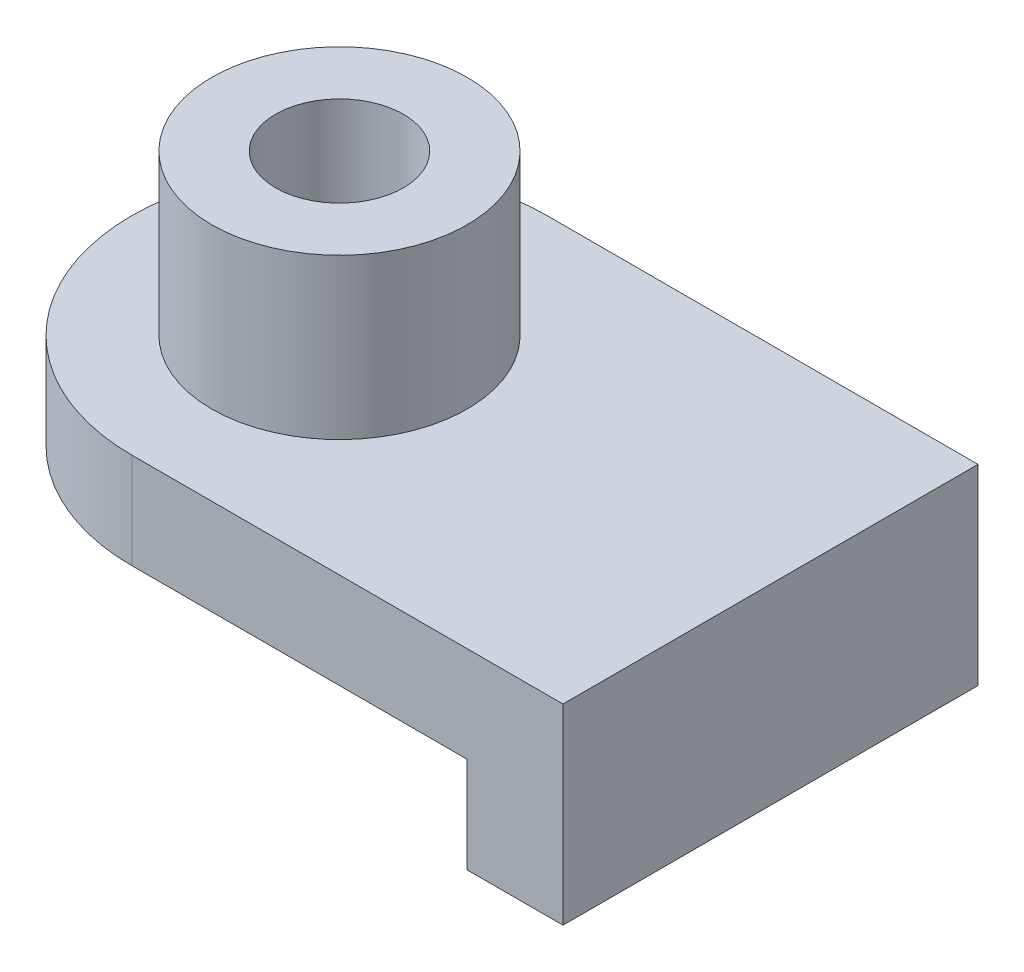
ISO-10303-21;
HEADER;
FILE_DESCRIPTION(('STEP AP214'),'2;1');
FILE_NAME('part.step','',(''),(''),'','','');
FILE_SCHEMA(('AUTOMOTIVE_DESIGN { 1 0 10303 214 1 1 1 1 }'));
ENDSEC;
DATA;
#1=APPLICATION_CONTEXT('core data for automotive mechanical design processes');
#2=APPLICATION_PROTOCOL_DEFINITION('international standard','automotive_design',2000,#1);
#3=PRODUCT_CONTEXT('',#1,'mechanical');
#4=PRODUCT('Part','Part','',(#3));
#5=PRODUCT_RELATED_PRODUCT_CATEGORY('part','',(#4));
#6=PRODUCT_DEFINITION_FORMATION('','',#4);
#7=PRODUCT_DEFINITION_CONTEXT('part definition',#1,'design');
#8=PRODUCT_DEFINITION('design','',#6,#7);
#9=PRODUCT_DEFINITION_SHAPE('','',#8);
#10=(LENGTH_UNIT() NAMED_UNIT(*) SI_UNIT(.MILLI.,.METRE.));
#11=(NAMED_UNIT(*) PLANE_ANGLE_UNIT() SI_UNIT($,.RADIAN.));
#12=(NAMED_UNIT(*) SI_UNIT($,.STERADIAN.) SOLID_ANGLE_UNIT());
#13=UNCERTAINTY_MEASURE_WITH_UNIT(LENGTH_MEASURE(1.E-05),#10,'distance_accuracy_value','');
#14=(GEOMETRIC_REPRESENTATION_CONTEXT(3) GLOBAL_UNCERTAINTY_ASSIGNED_CONTEXT((#13)) GLOBAL_UNIT_ASSIGNED_CONTEXT((#10,
#11,#12)) REPRESENTATION_CONTEXT('',''));
#15=CARTESIAN_POINT('',(0.,0.,0.));
#16=DIRECTION('',(0.,0.,1.));
#17=DIRECTION('',(1.,0.,0.));
#18=AXIS2_PLACEMENT_3D('',#15,#16,#17);
#19=CARTESIAN_POINT('',(-67.5,15.,0.));
#20=DIRECTION('',(0.,0.,-1.));
#21=DIRECTION('',(-1.,0.,0.));
#22=AXIS2_PLACEMENT_3D('',#19,#20,#21);
#23=PLANE('',#22);
#24=DIRECTION('',(1.,0.,0.));
#25=VECTOR('',#24,1.);
#26=CARTESIAN_POINT('',(-67.5,0.,0.));
#27=LINE('',#26,#25);
#28=CARTESIAN_POINT('',(-67.5,0.,0.));
#29=VERTEX_POINT('',#28);
#30=CARTESIAN_POINT('',(-15.,0.,0.));
#31=VERTEX_POINT('',#30);
#32=EDGE_CURVE('E121',#29,#31,#27,.T.);
#33=ORIENTED_EDGE('',*,*,#32,.T.);
#34=DIRECTION('',(0.,-1.,0.));
#35=VECTOR('',#34,1.);
#36=CARTESIAN_POINT('',(-15.,-15.,0.));
#37=LINE('',#36,#35);
#38=CARTESIAN_POINT('',(-15.,-15.,0.));
#39=VERTEX_POINT('',#38);
#40=EDGE_CURVE('E54',#31,#39,#37,.T.);
#41=ORIENTED_EDGE('',*,*,#40,.T.);
#42=DIRECTION('',(1.,0.,0.));
#43=VECTOR('',#42,1.);
#44=CARTESIAN_POINT('',(0.,-15.,0.));
#45=LINE('',#44,#43);
#46=CARTESIAN_POINT('',(0.,-15.,0.));
#47=VERTEX_POINT('',#46);
#48=EDGE_CURVE('E117',#39,#47,#45,.T.);
#49=ORIENTED_EDGE('',*,*,#48,.T.);
#50=DIRECTION('',(0.,-1.,0.));
#51=VECTOR('',#50,1.);
#52=CARTESIAN_POINT('',(0.,15.,0.));
#53=LINE('',#52,#51);
#54=CARTESIAN_POINT('',(0.,15.,0.));
#55=VERTEX_POINT('',#54);
#56=EDGE_CURVE('E11',#55,#47,#53,.T.);
#57=ORIENTED_EDGE('',*,*,#56,.F.);
#58=DIRECTION('',(1.,0.,0.));
#59=VECTOR('',#58,1.);
#60=CARTESIAN_POINT('',(-67.5,15.,0.));
#61=LINE('',#60,#59);
#62=CARTESIAN_POINT('',(-67.5,15.,0.));
#63=VERTEX_POINT('',#62);
#64=EDGE_CURVE('E125',#63,#55,#61,.T.);
#65=ORIENTED_EDGE('',*,*,#64,.F.);
#66=DIRECTION('',(0.,-1.,0.));
#67=VECTOR('',#66,1.);
#68=CARTESIAN_POINT('',(-67.5,15.,0.));
#69=LINE('',#68,#67);
#70=EDGE_CURVE('E131',#63,#29,#69,.T.);
#71=ORIENTED_EDGE('',*,*,#70,.T.);
#72=EDGE_LOOP('',(#33,#41,#49,#57,#65,#71));
#73=FACE_BOUND('',#72,.T.);
#74=ADVANCED_FACE('F39',(#73),#23,.F.);
#75=CARTESIAN_POINT('',(0.,15.,0.));
#76=DIRECTION('',(-1.,0.,0.));
#77=DIRECTION('',(0.,0.,1.));
#78=AXIS2_PLACEMENT_3D('',#75,#76,#77);
#79=PLANE('',#78);
#80=ORIENTED_EDGE('',*,*,#56,.T.);
#81=DIRECTION('',(0.,0.,1.));
#82=VECTOR('',#81,1.);
#83=CARTESIAN_POINT('',(0.,-15.,-65.));
#84=LINE('',#83,#82);
#85=CARTESIAN_POINT('',(0.,-15.,-65.));
#86=VERTEX_POINT('',#85);
#87=EDGE_CURVE('E127',#86,#47,#84,.T.);
#88=ORIENTED_EDGE('',*,*,#87,.F.);
#89=DIRECTION('',(0.,-1.,0.));
#90=VECTOR('',#89,1.);
#91=CARTESIAN_POINT('',(0.,15.,-65.));
#92=LINE('',#91,#90);
#93=CARTESIAN_POINT('',(0.,15.,-65.));
#94=VERTEX_POINT('',#93);
#95=EDGE_CURVE('E47',#94,#86,#92,.T.);
#96=ORIENTED_EDGE('',*,*,#95,.F.);
#97=DIRECTION('',(0.,0.,-1.));
#98=VECTOR('',#97,1.);
#99=CARTESIAN_POINT('',(0.,15.,0.));
#100=LINE('',#99,#98);
#101=EDGE_CURVE('E85',#55,#94,#100,.T.);
#102=ORIENTED_EDGE('',*,*,#101,.F.);
#103=EDGE_LOOP('',(#80,#88,#96,#102));
#104=FACE_BOUND('',#103,.T.);
#105=ADVANCED_FACE('F141',(#104),#79,.F.);
#106=CARTESIAN_POINT('',(0.,15.,-65.));
#107=DIRECTION('',(0.,0.,1.));
#108=DIRECTION('',(1.,0.,0.));
#109=AXIS2_PLACEMENT_3D('',#106,#107,#108);
#110=PLANE('',#109);
#111=ORIENTED_EDGE('',*,*,#95,.T.);
#112=DIRECTION('',(1.,0.,0.));
#113=VECTOR('',#112,1.);
#114=CARTESIAN_POINT('',(0.,-15.,-65.));
#115=LINE('',#114,#113);
#116=CARTESIAN_POINT('',(-15.,-15.,-65.));
#117=VERTEX_POINT('',#116);
#118=EDGE_CURVE('E108',#117,#86,#115,.T.);
#119=ORIENTED_EDGE('',*,*,#118,.F.);
#120=DIRECTION('',(0.,-1.,0.));
#121=VECTOR('',#120,1.);
#122=CARTESIAN_POINT('',(-15.,-15.,-65.));
#123=LINE('',#122,#121);
#124=CARTESIAN_POINT('',(-15.,0.,-65.));
#125=VERTEX_POINT('',#124);
#126=EDGE_CURVE('E101',#125,#117,#123,.T.);
#127=ORIENTED_EDGE('',*,*,#126,.F.);
#128=DIRECTION('',(-1.,0.,0.));
#129=VECTOR('',#128,1.);
#130=CARTESIAN_POINT('',(0.,0.,-65.));
#131=LINE('',#130,#129);
#132=CARTESIAN_POINT('',(-67.5,0.,-65.));
#133=VERTEX_POINT('',#132);
#134=EDGE_CURVE('E114',#125,#133,#131,.T.);
#135=ORIENTED_EDGE('',*,*,#134,.T.);
#136=DIRECTION('',(0.,-1.,0.));
#137=VECTOR('',#136,1.);
#138=CARTESIAN_POINT('',(-67.5,15.,-65.));
#139=LINE('',#138,#137);
#140=CARTESIAN_POINT('',(-67.5,15.,-65.));
#141=VERTEX_POINT('',#140);
#142=EDGE_CURVE('E134',#141,#133,#139,.T.);
#143=ORIENTED_EDGE('',*,*,#142,.F.);
#144=DIRECTION('',(-1.,0.,0.));
#145=VECTOR('',#144,1.);
#146=CARTESIAN_POINT('',(0.,15.,-65.));
#147=LINE('',#146,#145);
#148=EDGE_CURVE('E139',#94,#141,#147,.T.);
#149=ORIENTED_EDGE('',*,*,#148,.F.);
#150=EDGE_LOOP('',(#111,#119,#127,#135,#143,#149));
#151=FACE_BOUND('',#150,.T.);
#152=ADVANCED_FACE('F112',(#151),#110,.F.);
#153=CARTESIAN_POINT('',(-67.5,15.,-32.5));
#154=DIRECTION('',(0.,-1.,0.));
#155=DIRECTION('',(0.,0.,-1.));
#156=AXIS2_PLACEMENT_3D('',#153,#154,#155);
#157=CYLINDRICAL_SURFACE('',#156,32.5);
#158=CARTESIAN_POINT('',(-67.5,0.,-32.5));
#159=DIRECTION('',(0.,1.,0.));
#160=DIRECTION('',(0.,0.,1.));
#161=AXIS2_PLACEMENT_3D('',#158,#159,#160);
#162=CIRCLE('',#161,32.5);
#163=EDGE_CURVE('E78',#133,#29,#162,.T.);
#164=ORIENTED_EDGE('',*,*,#163,.T.);
#165=ORIENTED_EDGE('',*,*,#70,.F.);
#166=CARTESIAN_POINT('',(-67.5,15.,-32.5));
#167=DIRECTION('',(0.,1.,0.));
#168=DIRECTION('',(0.,0.,1.));
#169=AXIS2_PLACEMENT_3D('',#166,#167,#168);
#170=CIRCLE('',#169,32.5);
#171=EDGE_CURVE('E63',#141,#63,#170,.T.);
#172=ORIENTED_EDGE('',*,*,#171,.F.);
#173=ORIENTED_EDGE('',*,*,#142,.T.);
#174=EDGE_LOOP('',(#164,#165,#172,#173));
#175=FACE_BOUND('',#174,.T.);
#176=ADVANCED_FACE('F167',(#175),#157,.T.);
#177=CARTESIAN_POINT('',(-67.5,15.,-32.5));
#178=DIRECTION('',(0.,1.,0.));
#179=DIRECTION('',(0.,0.,1.));
#180=AXIS2_PLACEMENT_3D('',#177,#178,#179);
#181=PLANE('',#180);
#182=CARTESIAN_POINT('',(-67.5,15.,-32.5));
#183=DIRECTION('',(0.,1.,0.));
#184=DIRECTION('',(0.,0.,1.));
#185=AXIS2_PLACEMENT_3D('',#182,#183,#184);
#186=CIRCLE('',#185,20.);
#187=CARTESIAN_POINT('',(-67.5,15.,-12.5));
#188=VERTEX_POINT('',#187);
#189=EDGE_CURVE('E212',#188,#188,#186,.T.);
#190=ORIENTED_EDGE('',*,*,#189,.F.);
#191=EDGE_LOOP('',(#190));
#192=FACE_BOUND('',#191,.T.);
#193=ORIENTED_EDGE('',*,*,#64,.T.);
#194=ORIENTED_EDGE('',*,*,#101,.T.);
#195=ORIENTED_EDGE('',*,*,#148,.T.);
#196=ORIENTED_EDGE('',*,*,#171,.T.);
#197=EDGE_LOOP('',(#193,#194,#195,#196));
#198=FACE_BOUND('',#197,.T.);
#199=ADVANCED_FACE('F166',(#192,#198),#181,.T.);
#200=CARTESIAN_POINT('',(-67.5,0.,-32.5));
#201=DIRECTION('',(0.,1.,0.));
#202=DIRECTION('',(0.,0.,1.));
#203=AXIS2_PLACEMENT_3D('',#200,#201,#202);
#204=PLANE('',#203);
#205=CARTESIAN_POINT('',(-67.5,0.,-32.5));
#206=DIRECTION('',(0.,1.,0.));
#207=DIRECTION('',(0.,0.,1.));
#208=AXIS2_PLACEMENT_3D('',#205,#206,#207);
#209=CIRCLE('',#208,9.99999999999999);
#210=CARTESIAN_POINT('',(-67.5,0.,-22.5));
#211=VERTEX_POINT('',#210);
#212=EDGE_CURVE('E210',#211,#211,#209,.T.);
#213=ORIENTED_EDGE('',*,*,#212,.T.);
#214=EDGE_LOOP('',(#213));
#215=FACE_BOUND('',#214,.T.);
#216=ORIENTED_EDGE('',*,*,#134,.F.);
#217=DIRECTION('',(0.,0.,1.));
#218=VECTOR('',#217,1.);
#219=CARTESIAN_POINT('',(-15.,0.,-65.));
#220=LINE('',#219,#218);
#221=EDGE_CURVE('E98',#125,#31,#220,.T.);
#222=ORIENTED_EDGE('',*,*,#221,.T.);
#223=ORIENTED_EDGE('',*,*,#32,.F.);
#224=ORIENTED_EDGE('',*,*,#163,.F.);
#225=EDGE_LOOP('',(#216,#222,#223,#224));
#226=FACE_BOUND('',#225,.T.);
#227=ADVANCED_FACE('F119',(#215,#226),#204,.F.);
#228=CARTESIAN_POINT('',(0.,-15.,-65.));
#229=DIRECTION('',(0.,-1.,0.));
#230=DIRECTION('',(1.,0.,0.));
#231=AXIS2_PLACEMENT_3D('',#228,#229,#230);
#232=PLANE('',#231);
#233=ORIENTED_EDGE('',*,*,#48,.F.);
#234=DIRECTION('',(0.,0.,1.));
#235=VECTOR('',#234,1.);
#236=CARTESIAN_POINT('',(-15.,-15.,-65.));
#237=LINE('',#236,#235);
#238=EDGE_CURVE('E107',#117,#39,#237,.T.);
#239=ORIENTED_EDGE('',*,*,#238,.F.);
#240=ORIENTED_EDGE('',*,*,#118,.T.);
#241=ORIENTED_EDGE('',*,*,#87,.T.);
#242=EDGE_LOOP('',(#233,#239,#240,#241));
#243=FACE_BOUND('',#242,.T.);
#244=ADVANCED_FACE('F148',(#243),#232,.T.);
#245=CARTESIAN_POINT('',(-15.,-15.,-65.));
#246=DIRECTION('',(-1.,0.,0.));
#247=DIRECTION('',(0.,0.,1.));
#248=AXIS2_PLACEMENT_3D('',#245,#246,#247);
#249=PLANE('',#248);
#250=ORIENTED_EDGE('',*,*,#40,.F.);
#251=ORIENTED_EDGE('',*,*,#221,.F.);
#252=ORIENTED_EDGE('',*,*,#126,.T.);
#253=ORIENTED_EDGE('',*,*,#238,.T.);
#254=EDGE_LOOP('',(#250,#251,#252,#253));
#255=FACE_BOUND('',#254,.T.);
#256=ADVANCED_FACE('F100',(#255),#249,.T.);
#257=CARTESIAN_POINT('',(-67.5,40.,-32.5));
#258=DIRECTION('',(0.,-1.,0.));
#259=DIRECTION('',(0.,0.,-1.));
#260=AXIS2_PLACEMENT_3D('',#257,#258,#259);
#261=CYLINDRICAL_SURFACE('',#260,20.);
#262=CARTESIAN_POINT('',(-67.5,40.,-32.5));
#263=DIRECTION('',(0.,1.,0.));
#264=DIRECTION('',(0.,0.,1.));
#265=AXIS2_PLACEMENT_3D('',#262,#263,#264);
#266=CIRCLE('',#265,20.);
#267=CARTESIAN_POINT('',(-67.5,40.,-12.5));
#268=VERTEX_POINT('',#267);
#269=EDGE_CURVE('E155',#268,#268,#266,.T.);
#270=ORIENTED_EDGE('',*,*,#269,.F.);
#271=EDGE_LOOP('',(#270));
#272=FACE_BOUND('',#271,.T.);
#273=ORIENTED_EDGE('',*,*,#189,.T.);
#274=EDGE_LOOP('',(#273));
#275=FACE_BOUND('',#274,.T.);
#276=ADVANCED_FACE('F189',(#272,#275),#261,.T.);
#277=CARTESIAN_POINT('',(-67.5,40.,-32.5));
#278=DIRECTION('',(0.,1.,0.));
#279=DIRECTION('',(0.,0.,1.));
#280=AXIS2_PLACEMENT_3D('',#277,#278,#279);
#281=PLANE('',#280);
#282=CARTESIAN_POINT('',(-67.5,40.,-32.5));
#283=DIRECTION('',(0.,1.,0.));
#284=DIRECTION('',(0.,0.,1.));
#285=AXIS2_PLACEMENT_3D('',#282,#283,#284);
#286=CIRCLE('',#285,9.99999999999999);
#287=CARTESIAN_POINT('',(-67.5,40.,-22.5));
#288=VERTEX_POINT('',#287);
#289=EDGE_CURVE('E207',#288,#288,#286,.T.);
#290=ORIENTED_EDGE('',*,*,#289,.F.);
#291=EDGE_LOOP('',(#290));
#292=FACE_BOUND('',#291,.T.);
#293=ORIENTED_EDGE('',*,*,#269,.T.);
#294=EDGE_LOOP('',(#293));
#295=FACE_BOUND('',#294,.T.);
#296=ADVANCED_FACE('F194',(#292,#295),#281,.T.);
#297=CARTESIAN_POINT('',(-67.5,-15.,-32.5));
#298=DIRECTION('',(0.,1.,0.));
#299=DIRECTION('',(0.,0.,1.));
#300=AXIS2_PLACEMENT_3D('',#297,#298,#299);
#301=CYLINDRICAL_SURFACE('',#300,9.99999999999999);
#302=ORIENTED_EDGE('',*,*,#289,.T.);
#303=EDGE_LOOP('',(#302));
#304=FACE_BOUND('',#303,.T.);
#305=ORIENTED_EDGE('',*,*,#212,.F.);
#306=EDGE_LOOP('',(#305));
#307=FACE_BOUND('',#306,.T.);
#308=ADVANCED_FACE('F198',(#304,#307),#301,.F.);
#309=CLOSED_SHELL('',(#74,#105,#152,#176,#199,#227,#244,#256,#276,#296,#308));
#310=MANIFOLD_SOLID_BREP('B2',#309);
#311=ADVANCED_BREP_SHAPE_REPRESENTATION('',(#18,#310),#14);
#312=SHAPE_DEFINITION_REPRESENTATION(#9,#311);
ENDSEC;
END-ISO-10303-21;
